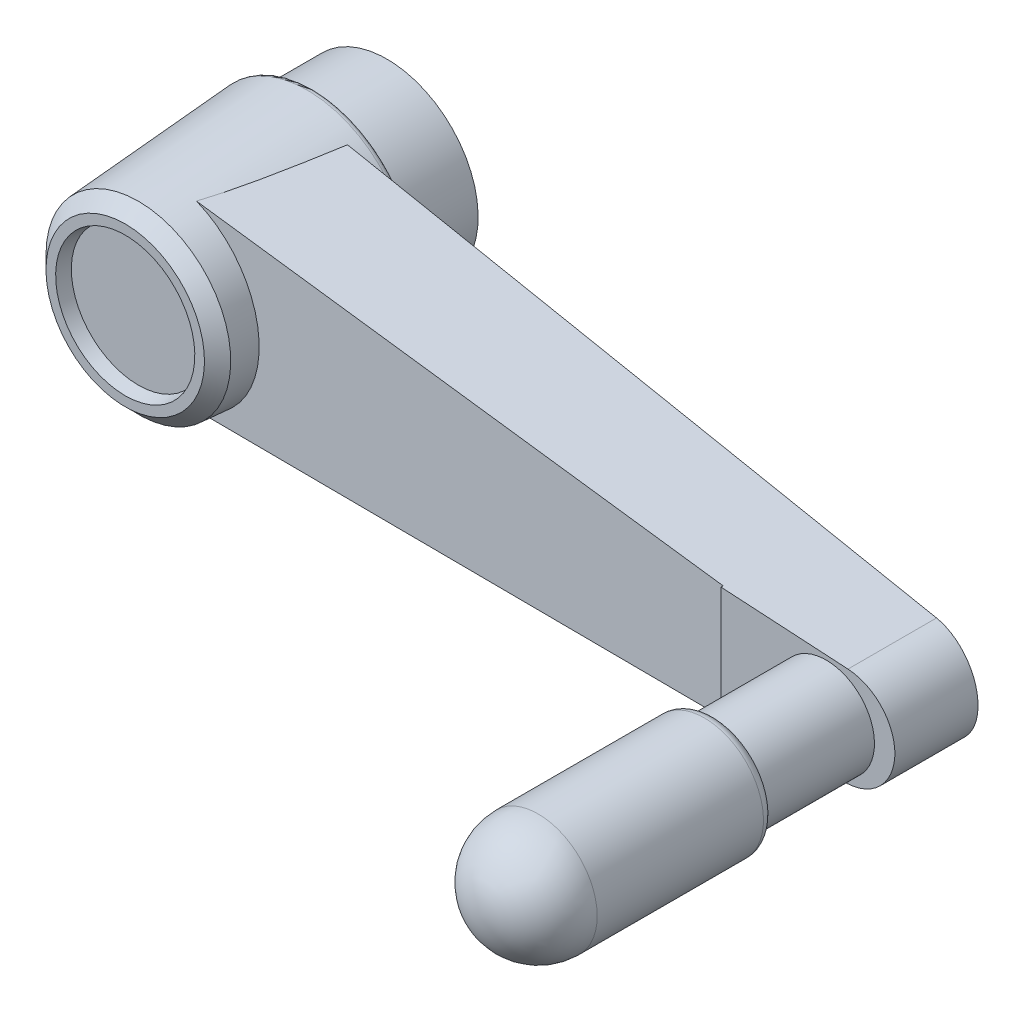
ISO-10303-21;
HEADER;
FILE_DESCRIPTION(('STEP AP214'),'2;1');
FILE_NAME('part.step','',(''),(''),'','','');
FILE_SCHEMA(('AUTOMOTIVE_DESIGN { 1 0 10303 214 1 1 1 1 }'));
ENDSEC;
DATA;
#1=APPLICATION_CONTEXT('core data for automotive mechanical design processes');
#2=APPLICATION_PROTOCOL_DEFINITION('international standard','automotive_design',2000,#1);
#3=PRODUCT_CONTEXT('',#1,'mechanical');
#4=PRODUCT('Part','Part','',(#3));
#5=PRODUCT_RELATED_PRODUCT_CATEGORY('part','',(#4));
#6=PRODUCT_DEFINITION_FORMATION('','',#4);
#7=PRODUCT_DEFINITION_CONTEXT('part definition',#1,'design');
#8=PRODUCT_DEFINITION('design','',#6,#7);
#9=PRODUCT_DEFINITION_SHAPE('','',#8);
#10=(LENGTH_UNIT() NAMED_UNIT(*) SI_UNIT(.MILLI.,.METRE.));
#11=(NAMED_UNIT(*) PLANE_ANGLE_UNIT() SI_UNIT($,.RADIAN.));
#12=(NAMED_UNIT(*) SI_UNIT($,.STERADIAN.) SOLID_ANGLE_UNIT());
#13=UNCERTAINTY_MEASURE_WITH_UNIT(LENGTH_MEASURE(1.E-05),#10,'distance_accuracy_value','');
#14=(GEOMETRIC_REPRESENTATION_CONTEXT(3) GLOBAL_UNCERTAINTY_ASSIGNED_CONTEXT((#13)) GLOBAL_UNIT_ASSIGNED_CONTEXT((#10,
#11,#12)) REPRESENTATION_CONTEXT('',''));
#15=CARTESIAN_POINT('',(0.,0.,0.));
#16=DIRECTION('',(0.,0.,1.));
#17=DIRECTION('',(1.,0.,0.));
#18=AXIS2_PLACEMENT_3D('',#15,#16,#17);
#19=CARTESIAN_POINT('',(0.,0.,30.0000000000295));
#20=DIRECTION('',(0.,0.,-1.));
#21=DIRECTION('',(0.,1.,0.));
#22=AXIS2_PLACEMENT_3D('',#19,#20,#21);
#23=CONICAL_SURFACE('',#22,6.99999999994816,1.04719755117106);
#24=CARTESIAN_POINT('',(1.70530256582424E-10,0.,34.0414518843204));
#25=VERTEX_POINT('',#24);
#26=VERTEX_LOOP('',#25);
#27=FACE_BOUND('',#26,.T.);
#28=CARTESIAN_POINT('',(0.,0.,30.));
#29=DIRECTION('',(0.,0.,-1.));
#30=DIRECTION('',(1.,0.,0.));
#31=AXIS2_PLACEMENT_3D('',#28,#29,#30);
#32=CIRCLE('',#31,7.);
#33=CARTESIAN_POINT('',(7.,0.,30.));
#34=VERTEX_POINT('',#33);
#35=EDGE_CURVE('E296',#34,#34,#32,.T.);
#36=ORIENTED_EDGE('',*,*,#35,.T.);
#37=EDGE_LOOP('',(#36));
#38=FACE_BOUND('',#37,.T.);
#39=ADVANCED_FACE('F15',(#27,#38),#23,.F.);
#40=CARTESIAN_POINT('',(0.,0.,15.4875));
#41=DIRECTION('',(0.,0.,-1.));
#42=DIRECTION('',(1.,0.,0.));
#43=AXIS2_PLACEMENT_3D('',#40,#41,#42);
#44=CYLINDRICAL_SURFACE('',#43,7.);
#45=CARTESIAN_POINT('',(0.,0.,0.975));
#46=DIRECTION('',(0.,0.,-1.));
#47=DIRECTION('',(1.,0.,0.));
#48=AXIS2_PLACEMENT_3D('',#45,#46,#47);
#49=CIRCLE('',#48,7.);
#50=CARTESIAN_POINT('',(7.,0.,0.975));
#51=VERTEX_POINT('',#50);
#52=EDGE_CURVE('E287',#51,#51,#49,.T.);
#53=ORIENTED_EDGE('',*,*,#52,.T.);
#54=EDGE_LOOP('',(#53));
#55=FACE_BOUND('',#54,.T.);
#56=ORIENTED_EDGE('',*,*,#35,.F.);
#57=EDGE_LOOP('',(#56));
#58=FACE_BOUND('',#57,.T.);
#59=ADVANCED_FACE('F397',(#55,#58),#44,.F.);
#60=CARTESIAN_POINT('',(0.,0.,0.));
#61=DIRECTION('',(0.,0.,-1.));
#62=DIRECTION('',(1.,0.,0.));
#63=AXIS2_PLACEMENT_3D('',#60,#61,#62);
#64=CONICAL_SURFACE('',#63,7.975,0.785398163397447);
#65=CARTESIAN_POINT('',(0.,0.,0.));
#66=DIRECTION('',(0.,0.,-1.));
#67=DIRECTION('',(1.,0.,0.));
#68=AXIS2_PLACEMENT_3D('',#65,#66,#67);
#69=CIRCLE('',#68,7.975);
#70=CARTESIAN_POINT('',(7.975,0.,0.));
#71=VERTEX_POINT('',#70);
#72=EDGE_CURVE('E284',#71,#71,#69,.F.);
#73=ORIENTED_EDGE('',*,*,#72,.F.);
#74=EDGE_LOOP('',(#73));
#75=FACE_BOUND('',#74,.T.);
#76=ORIENTED_EDGE('',*,*,#52,.F.);
#77=EDGE_LOOP('',(#76));
#78=FACE_BOUND('',#77,.T.);
#79=ADVANCED_FACE('F402',(#75,#78),#64,.F.);
#80=CARTESIAN_POINT('',(-6.5,0.,0.));
#81=DIRECTION('',(0.,0.,-1.));
#82=DIRECTION('',(0.,1.,0.));
#83=AXIS2_PLACEMENT_3D('',#80,#81,#82);
#84=PLANE('',#83);
#85=CARTESIAN_POINT('',(0.,0.,0.));
#86=DIRECTION('',(0.,0.,1.));
#87=DIRECTION('',(0.,-1.,0.));
#88=AXIS2_PLACEMENT_3D('',#85,#86,#87);
#89=CIRCLE('',#88,13.);
#90=CARTESIAN_POINT('',(0.,-13.,0.));
#91=VERTEX_POINT('',#90);
#92=EDGE_CURVE('E281',#91,#91,#89,.T.);
#93=ORIENTED_EDGE('',*,*,#92,.F.);
#94=EDGE_LOOP('',(#93));
#95=FACE_BOUND('',#94,.T.);
#96=ORIENTED_EDGE('',*,*,#72,.T.);
#97=EDGE_LOOP('',(#96));
#98=FACE_BOUND('',#97,.T.);
#99=ADVANCED_FACE('F518',(#95,#98),#84,.T.);
#100=CARTESIAN_POINT('',(0.,0.,0.1));
#101=DIRECTION('',(0.,0.,1.));
#102=DIRECTION('',(0.,-1.,0.));
#103=AXIS2_PLACEMENT_3D('',#100,#101,#102);
#104=CYLINDRICAL_SURFACE('',#103,13.);
#105=ORIENTED_EDGE('',*,*,#92,.T.);
#106=EDGE_LOOP('',(#105));
#107=FACE_BOUND('',#106,.T.);
#108=CARTESIAN_POINT('',(0.,0.,0.200000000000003));
#109=DIRECTION('',(0.,0.,1.));
#110=DIRECTION('',(0.,-1.,0.));
#111=AXIS2_PLACEMENT_3D('',#108,#109,#110);
#112=CIRCLE('',#111,13.);
#113=CARTESIAN_POINT('',(0.,-13.,0.200000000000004));
#114=VERTEX_POINT('',#113);
#115=EDGE_CURVE('E278',#114,#114,#112,.T.);
#116=ORIENTED_EDGE('',*,*,#115,.F.);
#117=EDGE_LOOP('',(#116));
#118=FACE_BOUND('',#117,.T.);
#119=ADVANCED_FACE('F514',(#107,#118),#104,.T.);
#120=CARTESIAN_POINT('',(-15.,0.,0.2));
#121=DIRECTION('',(0.,0.,-1.));
#122=DIRECTION('',(1.,0.,0.));
#123=AXIS2_PLACEMENT_3D('',#120,#121,#122);
#124=PLANE('',#123);
#125=CARTESIAN_POINT('',(0.,0.,0.2));
#126=DIRECTION('',(0.,0.,1.));
#127=DIRECTION('',(0.,-1.,0.));
#128=AXIS2_PLACEMENT_3D('',#125,#126,#127);
#129=CIRCLE('',#128,17.);
#130=CARTESIAN_POINT('',(0.,-17.,0.200000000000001));
#131=VERTEX_POINT('',#130);
#132=EDGE_CURVE('E271',#131,#131,#129,.T.);
#133=ORIENTED_EDGE('',*,*,#132,.F.);
#134=EDGE_LOOP('',(#133));
#135=FACE_BOUND('',#134,.T.);
#136=ORIENTED_EDGE('',*,*,#115,.T.);
#137=EDGE_LOOP('',(#136));
#138=FACE_BOUND('',#137,.T.);
#139=ADVANCED_FACE('F509',(#135,#138),#124,.T.);
#140=CARTESIAN_POINT('',(-6.25,0.,46.55));
#141=DIRECTION('',(0.,0.,1.));
#142=DIRECTION('',(0.,-1.,0.));
#143=AXIS2_PLACEMENT_3D('',#140,#141,#142);
#144=PLANE('',#143);
#145=CARTESIAN_POINT('',(0.,0.,46.55));
#146=DIRECTION('',(0.,0.,1.));
#147=DIRECTION('',(0.,-1.,0.));
#148=AXIS2_PLACEMENT_3D('',#145,#146,#147);
#149=CIRCLE('',#148,12.5);
#150=CARTESIAN_POINT('',(0.,-12.5,46.55));
#151=VERTEX_POINT('',#150);
#152=EDGE_CURVE('E263',#151,#151,#149,.T.);
#153=ORIENTED_EDGE('',*,*,#152,.T.);
#154=EDGE_LOOP('',(#153));
#155=FACE_BOUND('',#154,.T.);
#156=ADVANCED_FACE('F242',(#155),#144,.T.);
#157=CARTESIAN_POINT('',(0.,0.,7.1));
#158=DIRECTION('',(0.,0.,1.));
#159=DIRECTION('',(0.,-1.,0.));
#160=AXIS2_PLACEMENT_3D('',#157,#158,#159);
#161=CYLINDRICAL_SURFACE('',#160,17.);
#162=ORIENTED_EDGE('',*,*,#132,.T.);
#163=EDGE_LOOP('',(#162));
#164=FACE_BOUND('',#163,.T.);
#165=CARTESIAN_POINT('',(0.,0.,14.));
#166=DIRECTION('',(0.,0.,1.));
#167=DIRECTION('',(0.,-1.,0.));
#168=AXIS2_PLACEMENT_3D('',#165,#166,#167);
#169=CIRCLE('',#168,17.);
#170=CARTESIAN_POINT('',(0.,-17.,14.));
#171=VERTEX_POINT('',#170);
#172=EDGE_CURVE('E266',#171,#171,#169,.T.);
#173=ORIENTED_EDGE('',*,*,#172,.F.);
#174=EDGE_LOOP('',(#173));
#175=FACE_BOUND('',#174,.T.);
#176=ADVANCED_FACE('F501',(#164,#175),#161,.T.);
#177=CARTESIAN_POINT('',(0.,0.,49.));
#178=DIRECTION('',(0.,0.,1.));
#179=DIRECTION('',(0.,-1.,0.));
#180=AXIS2_PLACEMENT_3D('',#177,#178,#179);
#181=CONICAL_SURFACE('',#180,12.9762317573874,0.191986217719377);
#182=CARTESIAN_POINT('',(0.,0.,49.));
#183=DIRECTION('',(0.,0.,1.));
#184=DIRECTION('',(0.,-1.,0.));
#185=AXIS2_PLACEMENT_3D('',#182,#183,#184);
#186=CIRCLE('',#185,12.9762317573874);
#187=CARTESIAN_POINT('',(0.,-12.9762317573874,49.));
#188=VERTEX_POINT('',#187);
#189=EDGE_CURVE('E217',#188,#188,#186,.F.);
#190=ORIENTED_EDGE('',*,*,#189,.F.);
#191=EDGE_LOOP('',(#190));
#192=FACE_BOUND('',#191,.T.);
#193=ORIENTED_EDGE('',*,*,#152,.F.);
#194=EDGE_LOOP('',(#193));
#195=FACE_BOUND('',#194,.T.);
#196=ADVANCED_FACE('F240',(#192,#195),#181,.F.);
#197=CARTESIAN_POINT('',(-17.7138156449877,0.,14.));
#198=DIRECTION('',(0.,0.,-1.));
#199=DIRECTION('',(0.,1.,0.));
#200=AXIS2_PLACEMENT_3D('',#197,#198,#199);
#201=PLANE('',#200);
#202=CARTESIAN_POINT('',(0.,0.,14.));
#203=DIRECTION('',(0.,0.,1.));
#204=DIRECTION('',(0.,-1.,0.));
#205=AXIS2_PLACEMENT_3D('',#202,#203,#204);
#206=CIRCLE('',#205,18.4276312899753);
#207=CARTESIAN_POINT('',(0.,-18.4276312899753,14.));
#208=VERTEX_POINT('',#207);
#209=CARTESIAN_POINT('',(0.,18.4276312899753,14.));
#210=VERTEX_POINT('',#209);
#211=EDGE_CURVE('E147',#208,#210,#206,.T.);
#212=ORIENTED_EDGE('',*,*,#211,.F.);
#213=CARTESIAN_POINT('',(0.,0.,14.));
#214=DIRECTION('',(0.,0.,1.));
#215=DIRECTION('',(-1.,0.,0.));
#216=AXIS2_PLACEMENT_3D('',#213,#214,#215);
#217=CIRCLE('',#216,18.4276312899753);
#218=CARTESIAN_POINT('',(-18.4276312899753,0.,14.));
#219=VERTEX_POINT('',#218);
#220=EDGE_CURVE('E259',#219,#208,#217,.T.);
#221=ORIENTED_EDGE('',*,*,#220,.F.);
#222=CARTESIAN_POINT('',(0.,0.,14.));
#223=DIRECTION('',(0.,0.,1.));
#224=DIRECTION('',(0.,1.,0.));
#225=AXIS2_PLACEMENT_3D('',#222,#223,#224);
#226=CIRCLE('',#225,18.4276312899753);
#227=EDGE_CURVE('E223',#210,#219,#226,.T.);
#228=ORIENTED_EDGE('',*,*,#227,.F.);
#229=EDGE_LOOP('',(#212,#221,#228));
#230=FACE_BOUND('',#229,.T.);
#231=ORIENTED_EDGE('',*,*,#172,.T.);
#232=EDGE_LOOP('',(#231));
#233=FACE_BOUND('',#232,.T.);
#234=ADVANCED_FACE('F229',(#230,#233),#201,.T.);
#235=CARTESIAN_POINT('',(-13.8750570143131,0.,49.));
#236=DIRECTION('',(0.,0.,1.));
#237=DIRECTION('',(0.,-1.,0.));
#238=AXIS2_PLACEMENT_3D('',#235,#236,#237);
#239=PLANE('',#238);
#240=ORIENTED_EDGE('',*,*,#189,.T.);
#241=EDGE_LOOP('',(#240));
#242=FACE_BOUND('',#241,.T.);
#243=CARTESIAN_POINT('',(0.,0.,49.));
#244=DIRECTION('',(0.,0.,-1.));
#245=DIRECTION('',(0.,1.,0.));
#246=AXIS2_PLACEMENT_3D('',#243,#244,#245);
#247=CIRCLE('',#246,14.7738822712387);
#248=CARTESIAN_POINT('',(0.,14.7738822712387,49.));
#249=VERTEX_POINT('',#248);
#250=EDGE_CURVE('E197',#249,#249,#247,.T.);
#251=ORIENTED_EDGE('',*,*,#250,.F.);
#252=EDGE_LOOP('',(#251));
#253=FACE_BOUND('',#252,.T.);
#254=ADVANCED_FACE('F239',(#242,#253),#239,.T.);
#255=CARTESIAN_POINT('',(0.,0.,46.55));
#256=DIRECTION('',(0.,0.,-1.));
#257=DIRECTION('',(0.,1.,0.));
#258=AXIS2_PLACEMENT_3D('',#255,#256,#257);
#259=CONICAL_SURFACE('',#258,17.2238822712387,0.785398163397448);
#260=CARTESIAN_POINT('',(0.,0.,46.55));
#261=DIRECTION('',(0.,0.,-1.));
#262=DIRECTION('',(-1.,0.,0.));
#263=AXIS2_PLACEMENT_3D('',#260,#261,#262);
#264=CIRCLE('',#263,17.2238822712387);
#265=CARTESIAN_POINT('',(-17.2238822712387,0.,46.55));
#266=VERTEX_POINT('',#265);
#267=EDGE_CURVE('E177',#266,#266,#264,.T.);
#268=ORIENTED_EDGE('',*,*,#267,.F.);
#269=EDGE_LOOP('',(#268));
#270=FACE_BOUND('',#269,.T.);
#271=ORIENTED_EDGE('',*,*,#250,.T.);
#272=EDGE_LOOP('',(#271));
#273=FACE_BOUND('',#272,.T.);
#274=ADVANCED_FACE('F166',(#270,#273),#259,.T.);
#275=CARTESIAN_POINT('',(0.,0.,15.));
#276=DIRECTION('',(0.,0.,-1.));
#277=DIRECTION('',(0.,1.,0.));
#278=AXIS2_PLACEMENT_3D('',#275,#276,#277);
#279=TOROIDAL_SURFACE('',#278,18.4276312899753,1.);
#280=ORIENTED_EDGE('',*,*,#220,.T.);
#281=ORIENTED_EDGE('',*,*,#211,.T.);
#282=ORIENTED_EDGE('',*,*,#227,.T.);
#283=EDGE_LOOP('',(#280,#281,#282));
#284=FACE_BOUND('',#283,.T.);
#285=CARTESIAN_POINT('',(0.,0.,15.0697564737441));
#286=DIRECTION('',(0.,0.,-1.));
#287=DIRECTION('',(-1.,0.,0.));
#288=AXIS2_PLACEMENT_3D('',#285,#286,#287);
#289=CIRCLE('',#288,19.4251953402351);
#290=CARTESIAN_POINT('',(-19.4251953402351,0.,15.0697564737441));
#291=VERTEX_POINT('',#290);
#292=EDGE_CURVE('E175',#291,#291,#289,.F.);
#293=ORIENTED_EDGE('',*,*,#292,.F.);
#294=EDGE_LOOP('',(#293));
#295=FACE_BOUND('',#294,.T.);
#296=ADVANCED_FACE('F154',(#284,#295),#279,.T.);
#297=CARTESIAN_POINT('',(-19.4,-35.,39.2));
#298=DIRECTION('',(0.0647288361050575,0.,-0.997902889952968));
#299=DIRECTION('',(0.997902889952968,0.,0.0647288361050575));
#300=AXIS2_PLACEMENT_3D('',#297,#298,#299);
#301=PLANE('',#300);
#302=CARTESIAN_POINT('',(-0.0800577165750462,0.,40.4531854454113));
#303=DIRECTION('',(0.0647288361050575,0.,-0.997902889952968));
#304=DIRECTION('',(-0.997902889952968,0.,-0.0647288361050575));
#305=AXIS2_PLACEMENT_3D('',#302,#303,#304);
#306=ELLIPSE('',#305,17.687305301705,17.6500315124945);
#307=CARTESIAN_POINT('',(5.06958801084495,-16.882100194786,40.7872164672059));
#308=VERTEX_POINT('',#307);
#309=CARTESIAN_POINT('',(5.06958800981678,16.8821001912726,40.7872165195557));
#310=VERTEX_POINT('',#309);
#311=EDGE_CURVE('E181',#308,#310,#306,.F.);
#312=ORIENTED_EDGE('',*,*,#311,.F.);
#313=DIRECTION('',(-0.996168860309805,-0.0589264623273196,-0.0646163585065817));
#314=VECTOR('',#313,1.);
#315=CARTESIAN_POINT('',(110.1,-10.6692271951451,47.6));
#316=LINE('',#315,#314);
#317=CARTESIAN_POINT('',(110.1,-10.6692271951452,47.6));
#318=VERTEX_POINT('',#317);
#319=EDGE_CURVE('E203',#318,#308,#316,.T.);
#320=ORIENTED_EDGE('',*,*,#319,.F.);
#321=DIRECTION('',(0.,-1.,0.));
#322=VECTOR('',#321,1.);
#323=CARTESIAN_POINT('',(110.1,-35.,47.6));
#324=LINE('',#323,#322);
#325=CARTESIAN_POINT('',(110.1,10.6692271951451,47.6));
#326=VERTEX_POINT('',#325);
#327=EDGE_CURVE('E191',#326,#318,#324,.T.);
#328=ORIENTED_EDGE('',*,*,#327,.F.);
#329=DIRECTION('',(0.996168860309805,-0.0589264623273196,0.0646163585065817));
#330=VECTOR('',#329,1.);
#331=CARTESIAN_POINT('',(5.06958799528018,16.8821001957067,40.7872165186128));
#332=LINE('',#331,#330);
#333=EDGE_CURVE('E185',#310,#326,#332,.T.);
#334=ORIENTED_EDGE('',*,*,#333,.F.);
#335=EDGE_LOOP('',(#312,#320,#328,#334));
#336=FACE_BOUND('',#335,.T.);
#337=ADVANCED_FACE('F165',(#336),#301,.F.);
#338=CARTESIAN_POINT('',(0.,0.,15.0697564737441));
#339=DIRECTION('',(0.,0.,-1.));
#340=DIRECTION('',(0.,1.,0.));
#341=AXIS2_PLACEMENT_3D('',#338,#339,#340);
#342=CONICAL_SURFACE('',#341,19.4251953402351,0.0698131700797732);
#343=ORIENTED_EDGE('',*,*,#292,.T.);
#344=EDGE_LOOP('',(#343));
#345=FACE_BOUND('',#344,.T.);
#346=CARTESIAN_POINT('',(-0.154489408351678,0.,16.197789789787));
#347=DIRECTION('',(-0.113460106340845,0.,0.993542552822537));
#348=DIRECTION('',(-0.993542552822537,0.,-0.113460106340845));
#349=AXIS2_PLACEMENT_3D('',#346,#347,#348);
#350=ELLIPSE('',#349,19.4720553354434,19.3456987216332);
#351=CARTESIAN_POINT('',(9.77403431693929,16.6038176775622,17.3316027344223));
#352=VERTEX_POINT('',#351);
#353=CARTESIAN_POINT('',(9.77403432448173,-16.6038176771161,17.3316026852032));
#354=VERTEX_POINT('',#353);
#355=EDGE_CURVE('E291',#352,#354,#350,.F.);
#356=ORIENTED_EDGE('',*,*,#355,.T.);
#357=CARTESIAN_POINT('',(9.77403432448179,-16.6038176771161,17.3316026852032));
#358=CARTESIAN_POINT('',(9.62284402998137,-16.6127610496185,18.3178354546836));
#359=CARTESIAN_POINT('',(9.46873269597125,-16.6218772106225,19.3036289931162));
#360=CARTESIAN_POINT('',(9.15339026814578,-16.640530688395,21.2740465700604));
#361=CARTESIAN_POINT('',(8.99215934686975,-16.6500679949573,22.2586706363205));
#362=CARTESIAN_POINT('',(8.66144965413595,-16.6696304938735,24.2255735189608));
#363=CARTESIAN_POINT('',(8.49197884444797,-16.6796552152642,25.2078536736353));
#364=CARTESIAN_POINT('',(8.14282085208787,-16.7003089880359,27.1706514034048));
#365=CARTESIAN_POINT('',(7.96313313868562,-16.7109380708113,28.151168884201));
#366=CARTESIAN_POINT('',(7.5909605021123,-16.7329532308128,30.1101578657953));
#367=CARTESIAN_POINT('',(7.39847075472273,-16.7443395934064,31.0886284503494));
#368=CARTESIAN_POINT('',(6.99713397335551,-16.768079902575,33.0421040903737));
#369=CARTESIAN_POINT('',(6.78828911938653,-16.7804337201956,34.017109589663));
#370=CARTESIAN_POINT('',(6.45821792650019,-16.7999584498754,35.476311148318));
#371=CARTESIAN_POINT('',(6.34533349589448,-16.8066359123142,35.9624003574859));
#372=CARTESIAN_POINT('',(6.1128671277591,-16.8203870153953,36.932951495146));
#373=CARTESIAN_POINT('',(5.99328549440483,-16.8274606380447,37.4174134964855));
#374=CARTESIAN_POINT('',(5.74591931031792,-16.8420931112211,38.3844739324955));
#375=CARTESIAN_POINT('',(5.6181311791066,-16.8496521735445,38.8670714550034));
#376=CARTESIAN_POINT('',(5.4187607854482,-16.861445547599,39.5888760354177));
#377=CARTESIAN_POINT('',(5.35101704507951,-16.8654527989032,39.8291475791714));
#378=CARTESIAN_POINT('',(5.21259548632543,-16.8736408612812,40.3088498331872));
#379=CARTESIAN_POINT('',(5.14191755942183,-16.8778216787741,40.5482805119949));
#380=CARTESIAN_POINT('',(5.06958802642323,-16.8821001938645,40.7872164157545));
#381=B_SPLINE_CURVE_WITH_KNOTS('',3,(#357,#358,#359,#360,#361,#362,#363,#364,#365,#366,#367,
#368,#369,#370,#371,#372,#373,#374,#375,#376,#377,#378,#379,#380),.UNSPECIFIED.,.F.,.F.,(4,2,2,
2,2,2,2,2,2,2,2,4),(0.,2.99339366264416,5.9867148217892,8.97719904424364,11.9678387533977,
14.9596118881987,17.9509869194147,19.4481574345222,20.9452600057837,22.4430202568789,
23.1920170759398,23.9410416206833),.UNSPECIFIED.);
#382=EDGE_CURVE('E421',#354,#308,#381,.T.);
#383=ORIENTED_EDGE('',*,*,#382,.T.);
#384=ORIENTED_EDGE('',*,*,#311,.T.);
#385=CARTESIAN_POINT('',(5.06958799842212,16.882100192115,40.7872165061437));
#386=CARTESIAN_POINT('',(5.1419175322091,16.8778216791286,40.5482806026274));
#387=CARTESIAN_POINT('',(5.21259545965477,16.8736408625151,40.3088499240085));
#388=CARTESIAN_POINT('',(5.35101701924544,16.8654528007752,39.8291476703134));
#389=CARTESIAN_POINT('',(5.41876075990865,16.8614455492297,39.5888761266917));
#390=CARTESIAN_POINT('',(5.61813115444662,16.8496521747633,38.8670715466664));
#391=CARTESIAN_POINT('',(5.74591928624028,16.842093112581,38.384474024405));
#392=CARTESIAN_POINT('',(5.99328547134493,16.8274606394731,37.4174135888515));
#393=CARTESIAN_POINT('',(6.11286710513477,16.8203870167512,36.9329515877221));
#394=CARTESIAN_POINT('',(6.34533347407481,16.8066359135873,35.9624004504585));
#395=CARTESIAN_POINT('',(6.45821790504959,16.7999584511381,35.476311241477));
#396=CARTESIAN_POINT('',(6.78828909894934,16.7804337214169,34.0171096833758));
#397=CARTESIAN_POINT('',(6.99713395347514,16.7680799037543,33.0421041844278));
#398=CARTESIAN_POINT('',(7.3984707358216,16.7443395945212,31.0886285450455));
#399=CARTESIAN_POINT('',(7.5909604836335,16.7329532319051,30.110157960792));
#400=CARTESIAN_POINT('',(7.96313312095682,16.7109380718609,28.1511689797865));
#401=CARTESIAN_POINT('',(8.14282083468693,16.7003089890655,27.1706514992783));
#402=CARTESIAN_POINT('',(8.49197882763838,16.6796552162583,25.2078537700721));
#403=CARTESIAN_POINT('',(8.66144963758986,16.6696304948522,24.2255736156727));
#404=CARTESIAN_POINT('',(8.99215933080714,16.6500679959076,22.2586707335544));
#405=CARTESIAN_POINT('',(9.15339025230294,16.6405306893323,21.2740466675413));
#406=CARTESIAN_POINT('',(9.46873268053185,16.6218772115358,19.3036290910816));
#407=CARTESIAN_POINT('',(9.62284401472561,16.6127610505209,18.3178355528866));
#408=CARTESIAN_POINT('',(9.7740343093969,16.6038176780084,17.3316027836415));
#409=B_SPLINE_CURVE_WITH_KNOTS('',3,(#385,#386,#387,#388,#389,#390,#391,#392,#393,#394,#395,
#396,#397,#398,#399,#400,#401,#402,#403,#404,#405,#406,#407,#408),.UNSPECIFIED.,.F.,.F.,(4,2,2,
2,2,2,2,2,2,2,2,4),(0.,0.749024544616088,1.49802136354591,2.9957816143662,4.49288418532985,
5.99005470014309,8.98142973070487,11.9732028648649,14.9638425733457,17.9543267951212,
20.947647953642,23.9410416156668),.UNSPECIFIED.);
#410=EDGE_CURVE('E37',#310,#352,#409,.T.);
#411=ORIENTED_EDGE('',*,*,#410,.T.);
#412=EDGE_LOOP('',(#356,#383,#384,#411));
#413=FACE_BOUND('',#412,.T.);
#414=ORIENTED_EDGE('',*,*,#267,.T.);
#415=EDGE_LOOP('',(#414));
#416=FACE_BOUND('',#415,.T.);
#417=ADVANCED_FACE('F440',(#345,#413,#416),#342,.T.);
#418=CARTESIAN_POINT('',(1.01282330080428,-17.1220703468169,84.));
#419=DIRECTION('',(0.0590498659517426,-0.998255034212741,0.));
#420=DIRECTION('',(0.998255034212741,0.0590498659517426,0.));
#421=AXIS2_PLACEMENT_3D('',#418,#419,#420);
#422=PLANE('',#421);
#423=DIRECTION('',(-1.42108547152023E-13,0.,1.));
#424=VECTOR('',#423,1.);
#425=CARTESIAN_POINT('',(110.1,-10.6692271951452,47.6));
#426=LINE('',#425,#424);
#427=CARTESIAN_POINT('',(110.1,-10.6692271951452,48.));
#428=VERTEX_POINT('',#427);
#429=EDGE_CURVE('E212',#428,#318,#426,.F.);
#430=ORIENTED_EDGE('',*,*,#429,.T.);
#431=ORIENTED_EDGE('',*,*,#319,.T.);
#432=ORIENTED_EDGE('',*,*,#382,.F.);
#433=DIRECTION('',(0.991831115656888,0.0586698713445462,0.113264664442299));
#434=VECTOR('',#433,1.);
#435=CARTESIAN_POINT('',(9.77403432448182,-16.6038176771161,17.3316026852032));
#436=LINE('',#435,#434);
#437=CARTESIAN_POINT('',(133.762605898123,-9.26951103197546,31.4907914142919));
#438=VERTEX_POINT('',#437);
#439=EDGE_CURVE('E417',#354,#438,#436,.T.);
#440=ORIENTED_EDGE('',*,*,#439,.T.);
#441=DIRECTION('',(0.,0.,1.));
#442=VECTOR('',#441,1.);
#443=CARTESIAN_POINT('',(133.762605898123,-9.26951103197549,84.));
#444=LINE('',#443,#442);
#445=CARTESIAN_POINT('',(133.762605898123,-9.26951103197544,48.));
#446=VERTEX_POINT('',#445);
#447=EDGE_CURVE('E463',#446,#438,#444,.F.);
#448=ORIENTED_EDGE('',*,*,#447,.F.);
#449=DIRECTION('',(0.998255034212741,0.0590498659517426,0.));
#450=VECTOR('',#449,1.);
#451=CARTESIAN_POINT('',(1.01282330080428,-17.1220703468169,48.));
#452=LINE('',#451,#450);
#453=EDGE_CURVE('E200',#446,#428,#452,.F.);
#454=ORIENTED_EDGE('',*,*,#453,.T.);
#455=EDGE_LOOP('',(#430,#431,#432,#440,#448,#454));
#456=FACE_BOUND('',#455,.T.);
#457=ADVANCED_FACE('F436',(#456),#422,.T.);
#458=CARTESIAN_POINT('',(110.1,-35.,47.6));
#459=DIRECTION('',(1.,0.,1.42108547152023E-13));
#460=DIRECTION('',(-1.42108547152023E-13,0.,1.));
#461=AXIS2_PLACEMENT_3D('',#458,#459,#460);
#462=PLANE('',#461);
#463=DIRECTION('',(0.,1.,0.));
#464=VECTOR('',#463,1.);
#465=CARTESIAN_POINT('',(110.1,-35.,48.));
#466=LINE('',#465,#464);
#467=CARTESIAN_POINT('',(110.1,10.6692271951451,48.));
#468=VERTEX_POINT('',#467);
#469=EDGE_CURVE('E188',#428,#468,#466,.T.);
#470=ORIENTED_EDGE('',*,*,#469,.T.);
#471=DIRECTION('',(-1.42108547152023E-13,0.,1.));
#472=VECTOR('',#471,1.);
#473=CARTESIAN_POINT('',(110.1,10.6692271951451,47.6));
#474=LINE('',#473,#472);
#475=EDGE_CURVE('E209',#326,#468,#474,.T.);
#476=ORIENTED_EDGE('',*,*,#475,.F.);
#477=ORIENTED_EDGE('',*,*,#327,.T.);
#478=ORIENTED_EDGE('',*,*,#429,.F.);
#479=EDGE_LOOP('',(#470,#476,#477,#478));
#480=FACE_BOUND('',#479,.T.);
#481=ADVANCED_FACE('F451',(#480),#462,.F.);
#482=CARTESIAN_POINT('',(133.762605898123,9.26951103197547,84.));
#483=DIRECTION('',(0.0590498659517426,0.998255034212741,0.));
#484=DIRECTION('',(-0.998255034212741,0.0590498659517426,0.));
#485=AXIS2_PLACEMENT_3D('',#482,#483,#484);
#486=PLANE('',#485);
#487=DIRECTION('',(0.,0.,1.));
#488=VECTOR('',#487,1.);
#489=CARTESIAN_POINT('',(133.762605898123,9.26951103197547,84.));
#490=LINE('',#489,#488);
#491=CARTESIAN_POINT('',(133.762605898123,9.26951103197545,48.));
#492=VERTEX_POINT('',#491);
#493=CARTESIAN_POINT('',(133.762605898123,9.26951103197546,31.4907914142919));
#494=VERTEX_POINT('',#493);
#495=EDGE_CURVE('E184',#492,#494,#490,.F.);
#496=ORIENTED_EDGE('',*,*,#495,.T.);
#497=DIRECTION('',(-0.991831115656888,0.0586698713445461,-0.113264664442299));
#498=VECTOR('',#497,1.);
#499=CARTESIAN_POINT('',(133.762605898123,9.26951103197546,31.4907914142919));
#500=LINE('',#499,#498);
#501=EDGE_CURVE('E413',#494,#352,#500,.T.);
#502=ORIENTED_EDGE('',*,*,#501,.T.);
#503=ORIENTED_EDGE('',*,*,#410,.F.);
#504=ORIENTED_EDGE('',*,*,#333,.T.);
#505=ORIENTED_EDGE('',*,*,#475,.T.);
#506=DIRECTION('',(-0.998255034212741,0.0590498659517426,0.));
#507=VECTOR('',#506,1.);
#508=CARTESIAN_POINT('',(133.762605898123,9.26951103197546,48.));
#509=LINE('',#508,#507);
#510=EDGE_CURVE('E182',#468,#492,#509,.F.);
#511=ORIENTED_EDGE('',*,*,#510,.T.);
#512=EDGE_LOOP('',(#496,#502,#503,#504,#505,#511));
#513=FACE_BOUND('',#512,.T.);
#514=ADVANCED_FACE('F446',(#513),#486,.T.);
#515=CARTESIAN_POINT('',(133.214285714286,0.,84.));
#516=DIRECTION('',(0.,0.,1.));
#517=DIRECTION('',(0.,-1.,0.));
#518=AXIS2_PLACEMENT_3D('',#515,#516,#517);
#519=CYLINDRICAL_SURFACE('',#518,9.28571428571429);
#520=CARTESIAN_POINT('',(133.214285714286,0.,31.4281746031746));
#521=DIRECTION('',(-0.113460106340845,0.,0.993542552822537));
#522=DIRECTION('',(0.993542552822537,0.,0.113460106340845));
#523=AXIS2_PLACEMENT_3D('',#520,#521,#522);
#524=ELLIPSE('',#523,9.34606601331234,9.28571428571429);
#525=EDGE_CURVE('E414',#438,#494,#524,.T.);
#526=ORIENTED_EDGE('',*,*,#525,.T.);
#527=ORIENTED_EDGE('',*,*,#495,.F.);
#528=CARTESIAN_POINT('',(133.214285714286,0.,48.));
#529=DIRECTION('',(0.,0.,1.));
#530=DIRECTION('',(0.,-1.,0.));
#531=AXIS2_PLACEMENT_3D('',#528,#529,#530);
#532=CIRCLE('',#531,9.28571428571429);
#533=EDGE_CURVE('E484',#492,#446,#532,.F.);
#534=ORIENTED_EDGE('',*,*,#533,.T.);
#535=ORIENTED_EDGE('',*,*,#447,.T.);
#536=EDGE_LOOP('',(#526,#527,#534,#535));
#537=FACE_BOUND('',#536,.T.);
#538=ADVANCED_FACE('F450',(#537),#519,.T.);
#539=CARTESIAN_POINT('',(110.1,-35.,48.));
#540=DIRECTION('',(0.,0.,-1.));
#541=DIRECTION('',(0.,1.,0.));
#542=AXIS2_PLACEMENT_3D('',#539,#540,#541);
#543=PLANE('',#542);
#544=CARTESIAN_POINT('',(130.,0.,48.));
#545=DIRECTION('',(0.,0.,-1.));
#546=DIRECTION('',(0.,1.,0.));
#547=AXIS2_PLACEMENT_3D('',#544,#545,#546);
#548=CIRCLE('',#547,6.75);
#549=CARTESIAN_POINT('',(130.,6.75,48.));
#550=VERTEX_POINT('',#549);
#551=EDGE_CURVE('E9',#550,#550,#548,.T.);
#552=ORIENTED_EDGE('',*,*,#551,.T.);
#553=EDGE_LOOP('',(#552));
#554=FACE_BOUND('',#553,.T.);
#555=ORIENTED_EDGE('',*,*,#533,.F.);
#556=ORIENTED_EDGE('',*,*,#510,.F.);
#557=ORIENTED_EDGE('',*,*,#469,.F.);
#558=ORIENTED_EDGE('',*,*,#453,.F.);
#559=EDGE_LOOP('',(#555,#556,#557,#558));
#560=FACE_BOUND('',#559,.T.);
#561=ADVANCED_FACE('F168',(#554,#560),#543,.F.);
#562=CARTESIAN_POINT('',(142.6,-35.,32.5));
#563=DIRECTION('',(-0.113460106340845,0.,0.993542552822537));
#564=DIRECTION('',(-0.993542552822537,0.,-0.113460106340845));
#565=AXIS2_PLACEMENT_3D('',#562,#563,#564);
#566=PLANE('',#565);
#567=ORIENTED_EDGE('',*,*,#355,.F.);
#568=ORIENTED_EDGE('',*,*,#501,.F.);
#569=ORIENTED_EDGE('',*,*,#525,.F.);
#570=ORIENTED_EDGE('',*,*,#439,.F.);
#571=EDGE_LOOP('',(#567,#568,#569,#570));
#572=FACE_BOUND('',#571,.T.);
#573=CARTESIAN_POINT('',(130.,0.,31.0611111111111));
#574=DIRECTION('',(-0.113460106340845,0.,0.993542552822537));
#575=DIRECTION('',(-0.993542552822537,0.,-0.113460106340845));
#576=AXIS2_PLACEMENT_3D('',#573,#574,#575);
#577=ELLIPSE('',#576,3.34510081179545,3.3235);
#578=CARTESIAN_POINT('',(126.6765,0.,30.6815756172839));
#579=VERTEX_POINT('',#578);
#580=EDGE_CURVE('E180',#579,#579,#577,.F.);
#581=ORIENTED_EDGE('',*,*,#580,.F.);
#582=EDGE_LOOP('',(#581));
#583=FACE_BOUND('',#582,.T.);
#584=ADVANCED_FACE('F445',(#572,#583),#566,.F.);
#585=CARTESIAN_POINT('',(130.,0.,38.91175));
#586=DIRECTION('',(0.,0.,-1.));
#587=DIRECTION('',(0.,1.,0.));
#588=AXIS2_PLACEMENT_3D('',#585,#586,#587);
#589=CYLINDRICAL_SURFACE('',#588,3.3235);
#590=ORIENTED_EDGE('',*,*,#580,.T.);
#591=EDGE_LOOP('',(#590));
#592=FACE_BOUND('',#591,.T.);
#593=CARTESIAN_POINT('',(130.,0.,33.0904999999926));
#594=DIRECTION('',(0.,0.,1.));
#595=DIRECTION('',(0.,-1.,0.));
#596=AXIS2_PLACEMENT_3D('',#593,#594,#595);
#597=CIRCLE('',#596,3.3235);
#598=CARTESIAN_POINT('',(130.,-3.3235,33.0904999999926));
#599=VERTEX_POINT('',#598);
#600=EDGE_CURVE('E28',#599,#599,#597,.T.);
#601=ORIENTED_EDGE('',*,*,#600,.T.);
#602=EDGE_LOOP('',(#601));
#603=FACE_BOUND('',#602,.T.);
#604=ADVANCED_FACE('F393',(#592,#603),#589,.F.);
#605=CARTESIAN_POINT('',(130.,0.,37.));
#606=DIRECTION('',(0.,0.,1.));
#607=DIRECTION('',(0.,-1.,0.));
#608=AXIS2_PLACEMENT_3D('',#605,#606,#607);
#609=PLANE('',#608);
#610=DIRECTION('',(-0.866025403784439,0.5,0.));
#611=VECTOR('',#610,1.);
#612=CARTESIAN_POINT('',(130.,2.3094010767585,37.));
#613=LINE('',#612,#611);
#614=CARTESIAN_POINT('',(130.,2.30940107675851,37.));
#615=VERTEX_POINT('',#614);
#616=CARTESIAN_POINT('',(132.,1.15470053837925,37.));
#617=VERTEX_POINT('',#616);
#618=EDGE_CURVE('E354',#615,#617,#613,.F.);
#619=ORIENTED_EDGE('',*,*,#618,.T.);
#620=DIRECTION('',(0.,1.,0.));
#621=VECTOR('',#620,1.);
#622=CARTESIAN_POINT('',(132.,1.15470053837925,37.));
#623=LINE('',#622,#621);
#624=CARTESIAN_POINT('',(132.,-1.15470053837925,37.));
#625=VERTEX_POINT('',#624);
#626=EDGE_CURVE('E359',#617,#625,#623,.F.);
#627=ORIENTED_EDGE('',*,*,#626,.T.);
#628=DIRECTION('',(0.866025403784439,0.5,0.));
#629=VECTOR('',#628,1.);
#630=CARTESIAN_POINT('',(132.,-1.15470053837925,37.));
#631=LINE('',#630,#629);
#632=CARTESIAN_POINT('',(130.,-2.3094010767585,37.));
#633=VERTEX_POINT('',#632);
#634=EDGE_CURVE('E364',#625,#633,#631,.F.);
#635=ORIENTED_EDGE('',*,*,#634,.T.);
#636=DIRECTION('',(0.866025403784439,-0.5,0.));
#637=VECTOR('',#636,1.);
#638=CARTESIAN_POINT('',(130.,-2.3094010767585,37.));
#639=LINE('',#638,#637);
#640=CARTESIAN_POINT('',(128.,-1.15470053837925,37.));
#641=VERTEX_POINT('',#640);
#642=EDGE_CURVE('E114',#633,#641,#639,.F.);
#643=ORIENTED_EDGE('',*,*,#642,.T.);
#644=DIRECTION('',(0.,-1.,0.));
#645=VECTOR('',#644,1.);
#646=CARTESIAN_POINT('',(128.,-1.15470053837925,37.));
#647=LINE('',#646,#645);
#648=CARTESIAN_POINT('',(128.,1.15470053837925,37.));
#649=VERTEX_POINT('',#648);
#650=EDGE_CURVE('E98',#641,#649,#647,.F.);
#651=ORIENTED_EDGE('',*,*,#650,.T.);
#652=DIRECTION('',(-0.866025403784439,-0.5,0.));
#653=VECTOR('',#652,1.);
#654=CARTESIAN_POINT('',(128.,1.15470053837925,37.));
#655=LINE('',#654,#653);
#656=EDGE_CURVE('E103',#649,#615,#655,.F.);
#657=ORIENTED_EDGE('',*,*,#656,.T.);
#658=EDGE_LOOP('',(#619,#627,#635,#643,#651,#657));
#659=FACE_BOUND('',#658,.T.);
#660=ADVANCED_FACE('F17',(#659),#609,.F.);
#661=CARTESIAN_POINT('',(132.,-1.15470053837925,33.));
#662=DIRECTION('',(0.5,-0.866025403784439,0.));
#663=DIRECTION('',(0.866025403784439,0.5,0.));
#664=AXIS2_PLACEMENT_3D('',#661,#662,#663);
#665=PLANE('',#664);
#666=DIRECTION('',(0.,0.,1.));
#667=VECTOR('',#666,1.);
#668=CARTESIAN_POINT('',(132.,-1.15470053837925,33.));
#669=LINE('',#668,#667);
#670=CARTESIAN_POINT('',(132.,-1.15470053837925,33.));
#671=VERTEX_POINT('',#670);
#672=EDGE_CURVE('E362',#625,#671,#669,.F.);
#673=ORIENTED_EDGE('',*,*,#672,.T.);
#674=DIRECTION('',(0.866025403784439,0.5,0.));
#675=VECTOR('',#674,1.);
#676=CARTESIAN_POINT('',(130.,-2.3094010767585,33.));
#677=LINE('',#676,#675);
#678=CARTESIAN_POINT('',(130.,-2.3094010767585,33.));
#679=VERTEX_POINT('',#678);
#680=EDGE_CURVE('E345',#679,#671,#677,.T.);
#681=ORIENTED_EDGE('',*,*,#680,.F.);
#682=DIRECTION('',(0.,0.,1.));
#683=VECTOR('',#682,1.);
#684=CARTESIAN_POINT('',(130.,-2.3094010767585,33.));
#685=LINE('',#684,#683);
#686=EDGE_CURVE('E366',#633,#679,#685,.F.);
#687=ORIENTED_EDGE('',*,*,#686,.F.);
#688=ORIENTED_EDGE('',*,*,#634,.F.);
#689=EDGE_LOOP('',(#673,#681,#687,#688));
#690=FACE_BOUND('',#689,.T.);
#691=ADVANCED_FACE('F384',(#690),#665,.F.);
#692=CARTESIAN_POINT('',(130.,-2.3094010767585,33.));
#693=DIRECTION('',(-0.5,-0.866025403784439,0.));
#694=DIRECTION('',(0.866025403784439,-0.5,0.));
#695=AXIS2_PLACEMENT_3D('',#692,#693,#694);
#696=PLANE('',#695);
#697=ORIENTED_EDGE('',*,*,#686,.T.);
#698=DIRECTION('',(0.866025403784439,-0.5,0.));
#699=VECTOR('',#698,1.);
#700=CARTESIAN_POINT('',(128.,-1.15470053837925,33.));
#701=LINE('',#700,#699);
#702=CARTESIAN_POINT('',(128.,-1.15470053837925,33.));
#703=VERTEX_POINT('',#702);
#704=EDGE_CURVE('E348',#703,#679,#701,.T.);
#705=ORIENTED_EDGE('',*,*,#704,.F.);
#706=DIRECTION('',(0.,0.,1.));
#707=VECTOR('',#706,1.);
#708=CARTESIAN_POINT('',(128.,-1.15470053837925,33.));
#709=LINE('',#708,#707);
#710=EDGE_CURVE('E116',#641,#703,#709,.F.);
#711=ORIENTED_EDGE('',*,*,#710,.F.);
#712=ORIENTED_EDGE('',*,*,#642,.F.);
#713=EDGE_LOOP('',(#697,#705,#711,#712));
#714=FACE_BOUND('',#713,.T.);
#715=ADVANCED_FACE('F370',(#714),#696,.F.);
#716=CARTESIAN_POINT('',(128.,-1.15470053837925,33.));
#717=DIRECTION('',(-1.,0.,0.));
#718=DIRECTION('',(0.,-1.,0.));
#719=AXIS2_PLACEMENT_3D('',#716,#717,#718);
#720=PLANE('',#719);
#721=ORIENTED_EDGE('',*,*,#710,.T.);
#722=DIRECTION('',(0.,1.,0.));
#723=VECTOR('',#722,1.);
#724=CARTESIAN_POINT('',(128.,1.6165,33.));
#725=LINE('',#724,#723);
#726=CARTESIAN_POINT('',(128.,1.15470053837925,33.));
#727=VERTEX_POINT('',#726);
#728=EDGE_CURVE('E120',#727,#703,#725,.F.);
#729=ORIENTED_EDGE('',*,*,#728,.F.);
#730=DIRECTION('',(0.,0.,1.));
#731=VECTOR('',#730,1.);
#732=CARTESIAN_POINT('',(128.,1.15470053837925,33.));
#733=LINE('',#732,#731);
#734=EDGE_CURVE('E105',#649,#727,#733,.F.);
#735=ORIENTED_EDGE('',*,*,#734,.F.);
#736=ORIENTED_EDGE('',*,*,#650,.F.);
#737=EDGE_LOOP('',(#721,#729,#735,#736));
#738=FACE_BOUND('',#737,.T.);
#739=ADVANCED_FACE('F118',(#738),#720,.F.);
#740=CARTESIAN_POINT('',(128.,1.15470053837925,33.));
#741=DIRECTION('',(-0.5,0.866025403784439,0.));
#742=DIRECTION('',(-0.866025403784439,-0.5,0.));
#743=AXIS2_PLACEMENT_3D('',#740,#741,#742);
#744=PLANE('',#743);
#745=ORIENTED_EDGE('',*,*,#734,.T.);
#746=DIRECTION('',(-0.866025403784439,-0.5,0.));
#747=VECTOR('',#746,1.);
#748=CARTESIAN_POINT('',(130.,2.3094010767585,33.));
#749=LINE('',#748,#747);
#750=CARTESIAN_POINT('',(130.,2.30940107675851,33.));
#751=VERTEX_POINT('',#750);
#752=EDGE_CURVE('E352',#751,#727,#749,.T.);
#753=ORIENTED_EDGE('',*,*,#752,.F.);
#754=DIRECTION('',(0.,0.,1.));
#755=VECTOR('',#754,1.);
#756=CARTESIAN_POINT('',(130.,2.3094010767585,33.));
#757=LINE('',#756,#755);
#758=EDGE_CURVE('E108',#751,#615,#757,.T.);
#759=ORIENTED_EDGE('',*,*,#758,.T.);
#760=ORIENTED_EDGE('',*,*,#656,.F.);
#761=EDGE_LOOP('',(#745,#753,#759,#760));
#762=FACE_BOUND('',#761,.T.);
#763=ADVANCED_FACE('F104',(#762),#744,.F.);
#764=CARTESIAN_POINT('',(130.,2.3094010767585,33.));
#765=DIRECTION('',(0.5,0.866025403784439,0.));
#766=DIRECTION('',(-0.866025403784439,0.5,0.));
#767=AXIS2_PLACEMENT_3D('',#764,#765,#766);
#768=PLANE('',#767);
#769=ORIENTED_EDGE('',*,*,#758,.F.);
#770=DIRECTION('',(-0.866025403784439,0.5,0.));
#771=VECTOR('',#770,1.);
#772=CARTESIAN_POINT('',(132.,1.15470053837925,33.));
#773=LINE('',#772,#771);
#774=CARTESIAN_POINT('',(132.,1.15470053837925,33.));
#775=VERTEX_POINT('',#774);
#776=EDGE_CURVE('E139',#775,#751,#773,.T.);
#777=ORIENTED_EDGE('',*,*,#776,.F.);
#778=DIRECTION('',(0.,0.,1.));
#779=VECTOR('',#778,1.);
#780=CARTESIAN_POINT('',(132.,1.15470053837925,33.));
#781=LINE('',#780,#779);
#782=EDGE_CURVE('E357',#617,#775,#781,.F.);
#783=ORIENTED_EDGE('',*,*,#782,.F.);
#784=ORIENTED_EDGE('',*,*,#618,.F.);
#785=EDGE_LOOP('',(#769,#777,#783,#784));
#786=FACE_BOUND('',#785,.T.);
#787=ADVANCED_FACE('F377',(#786),#768,.F.);
#788=CARTESIAN_POINT('',(132.,1.15470053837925,33.));
#789=DIRECTION('',(1.,0.,0.));
#790=DIRECTION('',(0.,1.,0.));
#791=AXIS2_PLACEMENT_3D('',#788,#789,#790);
#792=PLANE('',#791);
#793=ORIENTED_EDGE('',*,*,#782,.T.);
#794=DIRECTION('',(0.,1.,0.));
#795=VECTOR('',#794,1.);
#796=CARTESIAN_POINT('',(132.,1.6165,33.));
#797=LINE('',#796,#795);
#798=EDGE_CURVE('E342',#671,#775,#797,.T.);
#799=ORIENTED_EDGE('',*,*,#798,.F.);
#800=ORIENTED_EDGE('',*,*,#672,.F.);
#801=ORIENTED_EDGE('',*,*,#626,.F.);
#802=EDGE_LOOP('',(#793,#799,#800,#801));
#803=FACE_BOUND('',#802,.T.);
#804=ADVANCED_FACE('F382',(#803),#792,.F.);
#805=CARTESIAN_POINT('',(130.,1.6165,33.));
#806=DIRECTION('',(0.,0.,-1.));
#807=DIRECTION('',(0.,1.,0.));
#808=AXIS2_PLACEMENT_3D('',#805,#806,#807);
#809=PLANE('',#808);
#810=CARTESIAN_POINT('',(130.,0.,32.9999999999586));
#811=DIRECTION('',(0.,0.,1.));
#812=DIRECTION('',(0.,-1.,0.));
#813=AXIS2_PLACEMENT_3D('',#810,#811,#812);
#814=CIRCLE('',#813,3.23299999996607);
#815=CARTESIAN_POINT('',(130.,-3.23299999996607,32.9999999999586));
#816=VERTEX_POINT('',#815);
#817=EDGE_CURVE('E136',#816,#816,#814,.T.);
#818=ORIENTED_EDGE('',*,*,#817,.F.);
#819=EDGE_LOOP('',(#818));
#820=FACE_BOUND('',#819,.T.);
#821=ORIENTED_EDGE('',*,*,#798,.T.);
#822=ORIENTED_EDGE('',*,*,#776,.T.);
#823=ORIENTED_EDGE('',*,*,#752,.T.);
#824=ORIENTED_EDGE('',*,*,#728,.T.);
#825=ORIENTED_EDGE('',*,*,#704,.T.);
#826=ORIENTED_EDGE('',*,*,#680,.T.);
#827=EDGE_LOOP('',(#821,#822,#823,#824,#825,#826));
#828=FACE_BOUND('',#827,.T.);
#829=ADVANCED_FACE('F374',(#820,#828),#809,.T.);
#830=CARTESIAN_POINT('',(130.,0.,33.7670000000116));
#831=DIRECTION('',(0.,0.,1.));
#832=DIRECTION('',(0.,-1.,0.));
#833=AXIS2_PLACEMENT_3D('',#830,#831,#832);
#834=CONICAL_SURFACE('',#833,4.0000000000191,0.785398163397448);
#835=ORIENTED_EDGE('',*,*,#817,.T.);
#836=EDGE_LOOP('',(#835));
#837=FACE_BOUND('',#836,.T.);
#838=ORIENTED_EDGE('',*,*,#600,.F.);
#839=EDGE_LOOP('',(#838));
#840=FACE_BOUND('',#839,.T.);
#841=ADVANCED_FACE('F321',(#837,#840),#834,.T.);
#842=CARTESIAN_POINT('',(130.,0.,102.));
#843=DIRECTION('',(0.,0.,1.));
#844=DIRECTION('',(0.,1.,0.));
#845=AXIS2_PLACEMENT_3D('',#842,#843,#844);
#846=SPHERICAL_SURFACE('',#845,11.);
#847=CARTESIAN_POINT('',(130.,0.,102.));
#848=DIRECTION('',(0.,0.,1.));
#849=DIRECTION('',(0.,-1.,0.));
#850=AXIS2_PLACEMENT_3D('',#847,#848,#849);
#851=CIRCLE('',#850,11.);
#852=CARTESIAN_POINT('',(141.,-7.797177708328E-12,102.));
#853=VERTEX_POINT('',#852);
#854=EDGE_CURVE('E294',#853,#853,#851,.F.);
#855=ORIENTED_EDGE('',*,*,#854,.F.);
#856=CARTESIAN_POINT('',(130.,0.,113.));
#857=CARTESIAN_POINT('',(130.17998726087,-2.48571596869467E-13,113.000003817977));
#858=CARTESIAN_POINT('',(130.359974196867,-5.04062029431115E-13,112.995582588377));
#859=CARTESIAN_POINT('',(130.719514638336,-1.01442818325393E-12,112.977917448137));
#860=CARTESIAN_POINT('',(130.899068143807,-1.2693039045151E-12,112.964673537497));
#861=CARTESIAN_POINT('',(131.257308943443,-1.77782630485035E-12,112.929390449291));
#862=CARTESIAN_POINT('',(131.435996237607,-2.03147298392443E-12,112.907351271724));
#863=CARTESIAN_POINT('',(131.792074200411,-2.53692632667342E-12,112.854531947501));
#864=CARTESIAN_POINT('',(131.969464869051,-2.78873299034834E-12,112.823751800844));
#865=CARTESIAN_POINT('',(132.322522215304,-3.28989965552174E-12,112.753524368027));
#866=CARTESIAN_POINT('',(132.498188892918,-3.53925965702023E-12,112.714077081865));
#867=CARTESIAN_POINT('',(132.847375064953,-4.03493227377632E-12,112.626610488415));
#868=CARTESIAN_POINT('',(133.020894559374,-4.28124488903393E-12,112.578591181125));
#869=CARTESIAN_POINT('',(133.365368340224,-4.77022934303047E-12,112.474096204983));
#870=CARTESIAN_POINT('',(133.536322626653,-5.01290118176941E-12,112.41762053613));
#871=CARTESIAN_POINT('',(133.875254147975,-5.4940194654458E-12,112.296348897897));
#872=CARTESIAN_POINT('',(134.043231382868,-5.73246591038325E-12,112.231552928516));
#873=CARTESIAN_POINT('',(134.375804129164,-6.20455896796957E-12,112.093796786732));
#874=CARTESIAN_POINT('',(134.540399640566,-6.43820558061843E-12,112.020836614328));
#875=CARTESIAN_POINT('',(134.8658124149,-6.90013609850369E-12,111.866927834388));
#876=CARTESIAN_POINT('',(135.02662967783,-7.12842000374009E-12,111.785979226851));
#877=CARTESIAN_POINT('',(135.344098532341,-7.57907515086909E-12,111.616288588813));
#878=CARTESIAN_POINT('',(135.500750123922,-7.80144639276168E-12,111.52754655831));
#879=CARTESIAN_POINT('',(135.809510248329,-8.23974050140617E-12,111.342482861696));
#880=CARTESIAN_POINT('',(135.961618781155,-8.45566336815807E-12,111.246161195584));
#881=CARTESIAN_POINT('',(136.260926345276,-8.88054054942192E-12,111.046170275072));
#882=CARTESIAN_POINT('',(136.408125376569,-9.08949486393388E-12,110.942501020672));
#883=CARTESIAN_POINT('',(136.697259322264,-9.49993155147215E-12,110.728064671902));
#884=CARTESIAN_POINT('',(136.839194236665,-9.70141392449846E-12,110.617297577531));
#885=CARTESIAN_POINT('',(137.117458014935,-1.0096421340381E-11,110.388932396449));
#886=CARTESIAN_POINT('',(137.253786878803,-1.02899463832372E-11,110.271334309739));
#887=CARTESIAN_POINT('',(137.520510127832,-1.06685729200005E-11,110.02959044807));
#888=CARTESIAN_POINT('',(137.650904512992,-1.08536744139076E-11,109.905444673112));
#889=CARTESIAN_POINT('',(137.905444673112,-1.12150079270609E-11,109.650904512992));
#890=CARTESIAN_POINT('',(138.02959044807,-1.13912399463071E-11,109.520510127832));
#891=CARTESIAN_POINT('',(138.271334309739,-1.17344099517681E-11,109.253786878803));
#892=CARTESIAN_POINT('',(138.388932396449,-1.19013479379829E-11,109.117458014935));
#893=CARTESIAN_POINT('',(138.617297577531,-1.22255277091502E-11,108.839194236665));
#894=CARTESIAN_POINT('',(138.728064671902,-1.23827694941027E-11,108.697259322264));
#895=CARTESIAN_POINT('',(138.942501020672,-1.26871780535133E-11,108.408125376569));
#896=CARTESIAN_POINT('',(139.046170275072,-1.28343448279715E-11,108.260926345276));
#897=CARTESIAN_POINT('',(139.246161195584,-1.31182488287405E-11,107.961618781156));
#898=CARTESIAN_POINT('',(139.342482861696,-1.32549860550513E-11,107.809510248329));
#899=CARTESIAN_POINT('',(139.52754655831,-1.35177015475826E-11,107.500750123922));
#900=CARTESIAN_POINT('',(139.616288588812,-1.36436798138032E-11,107.344098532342));
#901=CARTESIAN_POINT('',(139.785979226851,-1.38845738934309E-11,107.02662967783));
#902=CARTESIAN_POINT('',(139.866927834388,-1.39994897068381E-11,106.8658124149));
#903=CARTESIAN_POINT('',(140.020836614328,-1.42179820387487E-11,106.540399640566));
#904=CARTESIAN_POINT('',(140.093796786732,-1.4321558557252E-11,106.375804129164));
#905=CARTESIAN_POINT('',(140.231552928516,-1.45171227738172E-11,106.043231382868));
#906=CARTESIAN_POINT('',(140.296348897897,-1.46091104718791E-11,105.875254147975));
#907=CARTESIAN_POINT('',(140.41762053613,-1.47812754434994E-11,105.536322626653));
#908=CARTESIAN_POINT('',(140.474096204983,-1.48614527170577E-11,105.365368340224));
#909=CARTESIAN_POINT('',(140.578591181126,-1.50098036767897E-11,105.020894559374));
#910=CARTESIAN_POINT('',(140.626610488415,-1.50779773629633E-11,104.847375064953));
#911=CARTESIAN_POINT('',(140.714077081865,-1.52021569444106E-11,104.498188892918));
#912=CARTESIAN_POINT('',(140.753524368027,-1.52581628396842E-11,104.322522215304));
#913=CARTESIAN_POINT('',(140.823751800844,-1.53578717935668E-11,103.969464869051));
#914=CARTESIAN_POINT('',(140.854531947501,-1.54015748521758E-11,103.792074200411));
#915=CARTESIAN_POINT('',(140.907351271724,-1.54765733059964E-11,103.435996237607));
#916=CARTESIAN_POINT('',(140.929390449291,-1.55078687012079E-11,103.257308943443));
#917=CARTESIAN_POINT('',(140.964673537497,-1.55579747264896E-11,102.899068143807));
#918=CARTESIAN_POINT('',(140.977917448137,-1.55767853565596E-11,102.719514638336));
#919=CARTESIAN_POINT('',(140.995582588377,-1.56018829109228E-11,102.359974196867));
#920=CARTESIAN_POINT('',(141.000003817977,-1.5608169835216E-11,102.17998726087));
#921=CARTESIAN_POINT('',(141.,-1.56081754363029E-11,102.));
#922=B_SPLINE_CURVE_WITH_KNOTS('',3,(#856,#857,#858,#859,#860,#861,#862,#863,#864,#865,#866,
#867,#868,#869,#870,#871,#872,#873,#874,#875,#876,#877,#878,#879,#880,#881,#882,#883,#884,#885,
#886,#887,#888,#889,#890,#891,#892,#893,#894,#895,#896,#897,#898,#899,#900,#901,#902,#903,#904,
#905,#906,#907,#908,#909,#910,#911,#912,#913,#914,#915,#916,#917,#918,#919,#920,#921),
.UNSPECIFIED.,.F.,.F.,(4,2,2,2,2,2,2,2,2,2,2,2,2,2,2,2,2,2,2,2,2,2,2,2,2,2,2,2,2,2,2,2,4),(0.,
0.539907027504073,1.07981405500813,1.61972108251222,2.15962811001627,2.69953513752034,
3.23944216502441,3.77934919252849,4.31925622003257,4.85916324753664,5.3990702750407,
5.93897730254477,6.47888433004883,7.01879135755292,7.55869838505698,8.09860541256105,
8.63851244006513,9.17841946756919,9.71832649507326,10.2582335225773,10.7981405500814,
11.3380475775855,11.8779546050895,12.4178616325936,12.9577686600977,13.4976756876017,
14.0375827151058,14.5774897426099,15.117396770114,15.657303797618,16.1972108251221,
16.7371178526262,17.2770248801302),.UNSPECIFIED.);
#923=CARTESIAN_POINT('',(130.,0.,113.));
#924=VERTEX_POINT('',#923);
#925=EDGE_CURVE('E304',#924,#853,#922,.T.);
#926=ORIENTED_EDGE('',*,*,#925,.F.);
#927=ORIENTED_EDGE('',*,*,#925,.T.);
#928=EDGE_LOOP('',(#855,#926,#927));
#929=FACE_BOUND('',#928,.T.);
#930=ADVANCED_FACE('F310',(#929),#846,.T.);
#931=CARTESIAN_POINT('',(130.,0.,86.5));
#932=DIRECTION('',(0.,0.,1.));
#933=DIRECTION('',(0.,-1.,0.));
#934=AXIS2_PLACEMENT_3D('',#931,#932,#933);
#935=CYLINDRICAL_SURFACE('',#934,11.);
#936=CARTESIAN_POINT('',(130.,0.,71.));
#937=DIRECTION('',(0.,0.,1.));
#938=DIRECTION('',(0.,-1.,0.));
#939=AXIS2_PLACEMENT_3D('',#936,#937,#938);
#940=CIRCLE('',#939,11.);
#941=CARTESIAN_POINT('',(130.,-11.,71.));
#942=VERTEX_POINT('',#941);
#943=EDGE_CURVE('E297',#942,#942,#940,.T.);
#944=ORIENTED_EDGE('',*,*,#943,.T.);
#945=EDGE_LOOP('',(#944));
#946=FACE_BOUND('',#945,.T.);
#947=ORIENTED_EDGE('',*,*,#854,.T.);
#948=EDGE_LOOP('',(#947));
#949=FACE_BOUND('',#948,.T.);
#950=ADVANCED_FACE('F320',(#946,#949),#935,.T.);
#951=CARTESIAN_POINT('',(130.,0.,71.));
#952=DIRECTION('',(0.,0.,-1.));
#953=DIRECTION('',(-1.,0.,0.));
#954=AXIS2_PLACEMENT_3D('',#951,#952,#953);
#955=TOROIDAL_SURFACE('',#954,9.00000000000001,2.);
#956=CARTESIAN_POINT('',(130.,0.,69.));
#957=DIRECTION('',(0.,0.,-1.));
#958=DIRECTION('',(-1.,0.,0.));
#959=AXIS2_PLACEMENT_3D('',#956,#957,#958);
#960=CIRCLE('',#959,9.);
#961=CARTESIAN_POINT('',(121.,0.,69.));
#962=VERTEX_POINT('',#961);
#963=EDGE_CURVE('E128',#962,#962,#960,.F.);
#964=ORIENTED_EDGE('',*,*,#963,.T.);
#965=EDGE_LOOP('',(#964));
#966=FACE_BOUND('',#965,.T.);
#967=ORIENTED_EDGE('',*,*,#943,.F.);
#968=EDGE_LOOP('',(#967));
#969=FACE_BOUND('',#968,.T.);
#970=ADVANCED_FACE('F326',(#966,#969),#955,.T.);
#971=CARTESIAN_POINT('',(130.,0.,58.65));
#972=DIRECTION('',(0.,0.,1.));
#973=DIRECTION('',(0.,-1.,0.));
#974=AXIS2_PLACEMENT_3D('',#971,#972,#973);
#975=CYLINDRICAL_SURFACE('',#974,9.);
#976=ORIENTED_EDGE('',*,*,#963,.F.);
#977=EDGE_LOOP('',(#976));
#978=FACE_BOUND('',#977,.T.);
#979=CARTESIAN_POINT('',(130.,0.,48.3));
#980=DIRECTION('',(0.,0.,1.));
#981=DIRECTION('',(0.,-1.,0.));
#982=AXIS2_PLACEMENT_3D('',#979,#980,#981);
#983=CIRCLE('',#982,9.);
#984=CARTESIAN_POINT('',(130.,-9.,48.3));
#985=VERTEX_POINT('',#984);
#986=EDGE_CURVE('E125',#985,#985,#983,.T.);
#987=ORIENTED_EDGE('',*,*,#986,.T.);
#988=EDGE_LOOP('',(#987));
#989=FACE_BOUND('',#988,.T.);
#990=ADVANCED_FACE('F331',(#978,#989),#975,.T.);
#991=CARTESIAN_POINT('',(130.,7.875,48.3));
#992=DIRECTION('',(0.,0.,-1.));
#993=DIRECTION('',(0.,1.,0.));
#994=AXIS2_PLACEMENT_3D('',#991,#992,#993);
#995=PLANE('',#994);
#996=ORIENTED_EDGE('',*,*,#986,.F.);
#997=EDGE_LOOP('',(#996));
#998=FACE_BOUND('',#997,.T.);
#999=CARTESIAN_POINT('',(130.,0.,48.3));
#1000=DIRECTION('',(0.,0.,1.));
#1001=DIRECTION('',(0.,-1.,0.));
#1002=AXIS2_PLACEMENT_3D('',#999,#1000,#1001);
#1003=CIRCLE('',#1002,6.75);
#1004=CARTESIAN_POINT('',(130.,-6.75,48.3));
#1005=VERTEX_POINT('',#1004);
#1006=EDGE_CURVE('E129',#1005,#1005,#1003,.T.);
#1007=ORIENTED_EDGE('',*,*,#1006,.T.);
#1008=EDGE_LOOP('',(#1007));
#1009=FACE_BOUND('',#1008,.T.);
#1010=ADVANCED_FACE('F748',(#998,#1009),#995,.T.);
#1011=CARTESIAN_POINT('',(130.,0.,48.15));
#1012=DIRECTION('',(0.,0.,1.));
#1013=DIRECTION('',(0.,-1.,0.));
#1014=AXIS2_PLACEMENT_3D('',#1011,#1012,#1013);
#1015=CYLINDRICAL_SURFACE('',#1014,6.75);
#1016=ORIENTED_EDGE('',*,*,#551,.F.);
#1017=EDGE_LOOP('',(#1016));
#1018=FACE_BOUND('',#1017,.T.);
#1019=ORIENTED_EDGE('',*,*,#1006,.F.);
#1020=EDGE_LOOP('',(#1019));
#1021=FACE_BOUND('',#1020,.T.);
#1022=ADVANCED_FACE('F757',(#1018,#1021),#1015,.T.);
#1023=CLOSED_SHELL('',(#39,#59,#79,#99,#119,#139,#156,#176,#196,#234,#254,#274,#296,#337,#417,
#457,#481,#514,#538,#561,#584,#604,#660,#691,#715,#739,#763,#787,#804,#829,#841,#930,#950,#970,
#990,#1010,#1022));
#1024=CARTESIAN_POINT('',(130.,4.9915,48.));
#1025=DIRECTION('',(0.,0.,-1.));
#1026=DIRECTION('',(0.,1.,0.));
#1027=AXIS2_PLACEMENT_3D('',#1024,#1025,#1026);
#1028=PLANE('',#1027);
#1029=CARTESIAN_POINT('',(130.,0.,48.));
#1030=DIRECTION('',(0.,0.,1.));
#1031=DIRECTION('',(0.,-1.,0.));
#1032=AXIS2_PLACEMENT_3D('',#1029,#1030,#1031);
#1033=CIRCLE('',#1032,3.233);
#1034=CARTESIAN_POINT('',(130.,-3.233,48.));
#1035=VERTEX_POINT('',#1034);
#1036=EDGE_CURVE('E132',#1035,#1035,#1033,.T.);
#1037=ORIENTED_EDGE('',*,*,#1036,.T.);
#1038=EDGE_LOOP('',(#1037));
#1039=FACE_BOUND('',#1038,.T.);
#1040=CARTESIAN_POINT('',(130.,0.,48.0000000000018));
#1041=DIRECTION('',(0.,0.,1.));
#1042=DIRECTION('',(0.,-1.,0.));
#1043=AXIS2_PLACEMENT_3D('',#1040,#1041,#1042);
#1044=CIRCLE('',#1043,4.00000000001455);
#1045=CARTESIAN_POINT('',(130.,-4.00000000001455,48.0000000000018));
#1046=VERTEX_POINT('',#1045);
#1047=EDGE_CURVE('E192',#1046,#1046,#1044,.T.);
#1048=ORIENTED_EDGE('',*,*,#1047,.F.);
#1049=EDGE_LOOP('',(#1048));
#1050=FACE_BOUND('',#1049,.T.);
#1051=ADVANCED_FACE('F772',(#1039,#1050),#1028,.T.);
#1052=CARTESIAN_POINT('',(130.,0.,45.7330000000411));
#1053=DIRECTION('',(0.,0.,-1.));
#1054=DIRECTION('',(0.,1.,0.));
#1055=AXIS2_PLACEMENT_3D('',#1052,#1053,#1054);
#1056=CONICAL_SURFACE('',#1055,4.0000000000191,0.785398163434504);
#1057=CARTESIAN_POINT('',(130.,0.,46.4095000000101));
#1058=DIRECTION('',(0.,0.,-1.));
#1059=DIRECTION('',(0.,1.,0.));
#1060=AXIS2_PLACEMENT_3D('',#1057,#1058,#1059);
#1061=CIRCLE('',#1060,3.3235);
#1062=CARTESIAN_POINT('',(130.,3.3235,46.4095000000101));
#1063=VERTEX_POINT('',#1062);
#1064=EDGE_CURVE('E288',#1063,#1063,#1061,.T.);
#1065=ORIENTED_EDGE('',*,*,#1064,.F.);
#1066=EDGE_LOOP('',(#1065));
#1067=FACE_BOUND('',#1066,.T.);
#1068=CARTESIAN_POINT('',(130.,0.,46.5));
#1069=DIRECTION('',(0.,0.,1.));
#1070=DIRECTION('',(0.,-1.,0.));
#1071=AXIS2_PLACEMENT_3D('',#1068,#1069,#1070);
#1072=CIRCLE('',#1071,3.233);
#1073=CARTESIAN_POINT('',(130.,-3.233,46.5));
#1074=VERTEX_POINT('',#1073);
#1075=EDGE_CURVE('E135',#1074,#1074,#1072,.T.);
#1076=ORIENTED_EDGE('',*,*,#1075,.F.);
#1077=EDGE_LOOP('',(#1076));
#1078=FACE_BOUND('',#1077,.T.);
#1079=ADVANCED_FACE('F776',(#1067,#1078),#1056,.T.);
#1080=CARTESIAN_POINT('',(130.,0.,47.25));
#1081=DIRECTION('',(0.,0.,1.));
#1082=DIRECTION('',(0.,-1.,0.));
#1083=AXIS2_PLACEMENT_3D('',#1080,#1081,#1082);
#1084=CYLINDRICAL_SURFACE('',#1083,3.233);
#1085=ORIENTED_EDGE('',*,*,#1075,.T.);
#1086=EDGE_LOOP('',(#1085));
#1087=FACE_BOUND('',#1086,.T.);
#1088=ORIENTED_EDGE('',*,*,#1036,.F.);
#1089=EDGE_LOOP('',(#1088));
#1090=FACE_BOUND('',#1089,.T.);
#1091=ADVANCED_FACE('F787',(#1087,#1090),#1084,.T.);
#1092=ORIENTED_EDGE('',*,*,#1064,.T.);
#1093=EDGE_LOOP('',(#1092));
#1094=FACE_BOUND('',#1093,.T.);
#1095=CARTESIAN_POINT('',(130.,0.,47.3235));
#1096=DIRECTION('',(0.,0.,-1.));
#1097=DIRECTION('',(0.,1.,0.));
#1098=AXIS2_PLACEMENT_3D('',#1095,#1096,#1097);
#1099=CIRCLE('',#1098,3.3235);
#1100=CARTESIAN_POINT('',(130.,3.3235,47.3235));
#1101=VERTEX_POINT('',#1100);
#1102=EDGE_CURVE('E204',#1101,#1101,#1099,.T.);
#1103=ORIENTED_EDGE('',*,*,#1102,.F.);
#1104=EDGE_LOOP('',(#1103));
#1105=FACE_BOUND('',#1104,.T.);
#1106=ADVANCED_FACE('F659',(#1094,#1105),#589,.F.);
#1107=CARTESIAN_POINT('',(130.,0.,48.0000000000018));
#1108=DIRECTION('',(0.,0.,1.));
#1109=DIRECTION('',(0.,-1.,0.));
#1110=AXIS2_PLACEMENT_3D('',#1107,#1108,#1109);
#1111=CONICAL_SURFACE('',#1110,4.00000000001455,0.785398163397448);
#1112=ORIENTED_EDGE('',*,*,#1102,.T.);
#1113=EDGE_LOOP('',(#1112));
#1114=FACE_BOUND('',#1113,.T.);
#1115=ORIENTED_EDGE('',*,*,#1047,.T.);
#1116=EDGE_LOOP('',(#1115));
#1117=FACE_BOUND('',#1116,.T.);
#1118=ADVANCED_FACE('F806',(#1114,#1117),#1111,.F.);
#1119=CLOSED_SHELL('',(#1051,#1079,#1091,#1106,#1118));
#1120=ORIENTED_CLOSED_SHELL('',*,#1119,.T.);
#1121=BREP_WITH_VOIDS('B1',#1023,(#1120));
#1122=ADVANCED_BREP_SHAPE_REPRESENTATION('',(#18,#1121),#14);
#1123=SHAPE_DEFINITION_REPRESENTATION(#9,#1122);
ENDSEC;
END-ISO-10303-21;
